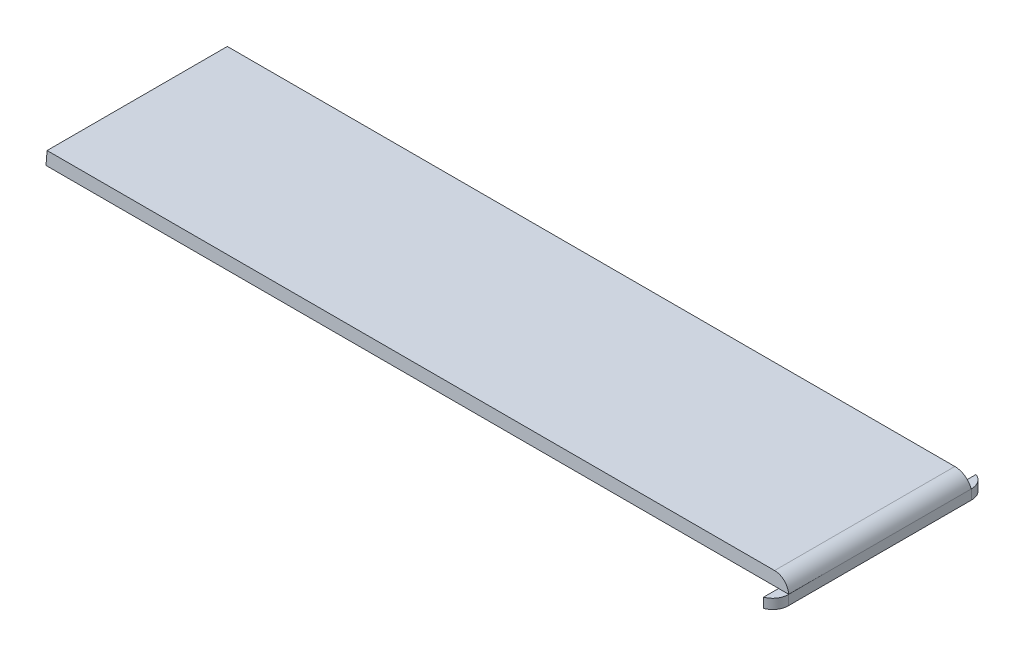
ISO-10303-21;
HEADER;
FILE_DESCRIPTION(('STEP AP214'),'2;1');
FILE_NAME('part.step','',(''),(''),'','','');
FILE_SCHEMA(('AUTOMOTIVE_DESIGN { 1 0 10303 214 1 1 1 1 }'));
ENDSEC;
DATA;
#1=APPLICATION_CONTEXT('core data for automotive mechanical design processes');
#2=APPLICATION_PROTOCOL_DEFINITION('international standard','automotive_design',2000,#1);
#3=PRODUCT_CONTEXT('',#1,'mechanical');
#4=PRODUCT('Part','Part','',(#3));
#5=PRODUCT_RELATED_PRODUCT_CATEGORY('part','',(#4));
#6=PRODUCT_DEFINITION_FORMATION('','',#4);
#7=PRODUCT_DEFINITION_CONTEXT('part definition',#1,'design');
#8=PRODUCT_DEFINITION('design','',#6,#7);
#9=PRODUCT_DEFINITION_SHAPE('','',#8);
#10=(LENGTH_UNIT() NAMED_UNIT(*) SI_UNIT(.MILLI.,.METRE.));
#11=(NAMED_UNIT(*) PLANE_ANGLE_UNIT() SI_UNIT($,.RADIAN.));
#12=(NAMED_UNIT(*) SI_UNIT($,.STERADIAN.) SOLID_ANGLE_UNIT());
#13=UNCERTAINTY_MEASURE_WITH_UNIT(LENGTH_MEASURE(1.E-05),#10,'distance_accuracy_value','');
#14=(GEOMETRIC_REPRESENTATION_CONTEXT(3) GLOBAL_UNCERTAINTY_ASSIGNED_CONTEXT((#13)) GLOBAL_UNIT_ASSIGNED_CONTEXT((#10,
#11,#12)) REPRESENTATION_CONTEXT('',''));
#15=CARTESIAN_POINT('',(0.,0.,0.));
#16=DIRECTION('',(0.,0.,1.));
#17=DIRECTION('',(1.,0.,0.));
#18=AXIS2_PLACEMENT_3D('',#15,#16,#17);
#19=CARTESIAN_POINT('',(0.,0.,0.));
#20=DIRECTION('',(0.,-1.,0.));
#21=DIRECTION('',(0.,0.,-1.));
#22=AXIS2_PLACEMENT_3D('',#19,#20,#21);
#23=PLANE('',#22);
#24=DIRECTION('',(1.,0.,0.));
#25=VECTOR('',#24,1.);
#26=CARTESIAN_POINT('',(-121.868681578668,0.,-11.3537769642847));
#27=LINE('',#26,#25);
#28=CARTESIAN_POINT('',(-121.412,0.,-11.3537769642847));
#29=VERTEX_POINT('',#28);
#30=CARTESIAN_POINT('',(-120.344681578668,0.,-11.3537769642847));
#31=VERTEX_POINT('',#30);
#32=EDGE_CURVE('E179',#29,#31,#27,.T.);
#33=ORIENTED_EDGE('',*,*,#32,.T.);
#34=CARTESIAN_POINT('',(-120.344681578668,0.,-12.6237769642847));
#35=DIRECTION('',(0.,1.,0.));
#36=DIRECTION('',(0.,0.,1.));
#37=AXIS2_PLACEMENT_3D('',#34,#35,#36);
#38=CIRCLE('',#37,1.26999999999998);
#39=CARTESIAN_POINT('',(-119.074681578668,0.,-12.6237769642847));
#40=VERTEX_POINT('',#39);
#41=EDGE_CURVE('E161',#31,#40,#38,.T.);
#42=ORIENTED_EDGE('',*,*,#41,.T.);
#43=DIRECTION('',(0.,0.,1.));
#44=VECTOR('',#43,1.);
#45=CARTESIAN_POINT('',(-119.074681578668,0.,-17.1957769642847));
#46=LINE('',#45,#44);
#47=CARTESIAN_POINT('',(-119.074681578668,0.,-17.1957769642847));
#48=VERTEX_POINT('',#47);
#49=EDGE_CURVE('E171',#48,#40,#46,.T.);
#50=ORIENTED_EDGE('',*,*,#49,.F.);
#51=CARTESIAN_POINT('',(-120.344681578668,0.,-17.1957769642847));
#52=DIRECTION('',(0.,1.,0.));
#53=DIRECTION('',(0.,0.,1.));
#54=AXIS2_PLACEMENT_3D('',#51,#52,#53);
#55=CIRCLE('',#54,1.27000000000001);
#56=CARTESIAN_POINT('',(-120.344681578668,0.,-18.4657769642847));
#57=VERTEX_POINT('',#56);
#58=EDGE_CURVE('E176',#48,#57,#55,.T.);
#59=ORIENTED_EDGE('',*,*,#58,.T.);
#60=DIRECTION('',(-1.,0.,0.));
#61=VECTOR('',#60,1.);
#62=CARTESIAN_POINT('',(-120.344681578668,0.,-18.4657769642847));
#63=LINE('',#62,#61);
#64=CARTESIAN_POINT('',(-121.412,0.,-18.4657769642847));
#65=VERTEX_POINT('',#64);
#66=EDGE_CURVE('E184',#57,#65,#63,.T.);
#67=ORIENTED_EDGE('',*,*,#66,.T.);
#68=DIRECTION('',(0.,0.,1.));
#69=VECTOR('',#68,1.);
#70=CARTESIAN_POINT('',(-121.412,0.,-29.8195539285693));
#71=LINE('',#70,#69);
#72=CARTESIAN_POINT('',(-121.412,0.,-29.8195539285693));
#73=VERTEX_POINT('',#72);
#74=EDGE_CURVE('E296',#73,#65,#71,.T.);
#75=ORIENTED_EDGE('',*,*,#74,.F.);
#76=DIRECTION('',(1.,0.,0.));
#77=VECTOR('',#76,1.);
#78=CARTESIAN_POINT('',(-121.412,0.,-29.8195539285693));
#79=LINE('',#78,#77);
#80=CARTESIAN_POINT('',(-1.651,0.,-29.8195539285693));
#81=VERTEX_POINT('',#80);
#82=EDGE_CURVE('E285',#73,#81,#79,.T.);
#83=ORIENTED_EDGE('',*,*,#82,.T.);
#84=DIRECTION('',(0.,0.,1.));
#85=VECTOR('',#84,1.);
#86=CARTESIAN_POINT('',(-1.651,0.,-32.2751212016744));
#87=LINE('',#86,#85);
#88=CARTESIAN_POINT('',(-1.65099999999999,0.,0.));
#89=VERTEX_POINT('',#88);
#90=EDGE_CURVE('E11',#81,#89,#87,.T.);
#91=ORIENTED_EDGE('',*,*,#90,.T.);
#92=DIRECTION('',(1.,0.,0.));
#93=VECTOR('',#92,1.);
#94=CARTESIAN_POINT('',(-121.412,0.,0.));
#95=LINE('',#94,#93);
#96=CARTESIAN_POINT('',(-121.412,0.,0.));
#97=VERTEX_POINT('',#96);
#98=EDGE_CURVE('E295',#97,#89,#95,.T.);
#99=ORIENTED_EDGE('',*,*,#98,.F.);
#100=EDGE_CURVE('E319',#29,#97,#71,.T.);
#101=ORIENTED_EDGE('',*,*,#100,.F.);
#102=EDGE_LOOP('',(#33,#42,#50,#59,#67,#75,#83,#91,#99,#101));
#103=FACE_BOUND('',#102,.T.);
#104=ADVANCED_FACE('F27',(#103),#23,.T.);
#105=CARTESIAN_POINT('',(-121.412,0.,-29.8195539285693));
#106=DIRECTION('',(0.,0.0871557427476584,-0.996194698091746));
#107=DIRECTION('',(0.,0.996194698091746,0.0871557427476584));
#108=AXIS2_PLACEMENT_3D('',#105,#106,#107);
#109=PLANE('',#108);
#110=DIRECTION('',(1.,0.,0.));
#111=VECTOR('',#110,1.);
#112=CARTESIAN_POINT('',(0.,2.032,-29.6417769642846));
#113=LINE('',#112,#111);
#114=CARTESIAN_POINT('',(-121.412,2.032,-29.6417769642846));
#115=VERTEX_POINT('',#114);
#116=CARTESIAN_POINT('',(-2.48868157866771,2.032,-29.6417769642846));
#117=VERTEX_POINT('',#116);
#118=EDGE_CURVE('E301',#115,#117,#113,.T.);
#119=ORIENTED_EDGE('',*,*,#118,.T.);
#120=CARTESIAN_POINT('',(-2.48868157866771,-0.508,-29.8639981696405));
#121=DIRECTION('',(0.,0.0871557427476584,-0.996194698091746));
#122=DIRECTION('',(0.,0.996194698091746,0.0871557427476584));
#123=AXIS2_PLACEMENT_3D('',#120,#121,#122);
#124=ELLIPSE('',#123,2.5497023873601,2.54);
#125=CARTESIAN_POINT('',(0.,0.,-29.8195539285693));
#126=VERTEX_POINT('',#125);
#127=EDGE_CURVE('E316',#117,#126,#124,.T.);
#128=ORIENTED_EDGE('',*,*,#127,.T.);
#129=EDGE_CURVE('E283',#81,#126,#79,.T.);
#130=ORIENTED_EDGE('',*,*,#129,.F.);
#131=ORIENTED_EDGE('',*,*,#82,.F.);
#132=DIRECTION('',(0.,-0.996194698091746,-0.0871557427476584));
#133=VECTOR('',#132,1.);
#134=CARTESIAN_POINT('',(-121.412,0.,-29.8195539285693));
#135=LINE('',#134,#133);
#136=EDGE_CURVE('E308',#115,#73,#135,.T.);
#137=ORIENTED_EDGE('',*,*,#136,.F.);
#138=EDGE_LOOP('',(#119,#128,#130,#131,#137));
#139=FACE_BOUND('',#138,.T.);
#140=ADVANCED_FACE('F29',(#139),#109,.T.);
#141=CARTESIAN_POINT('',(-121.412,2.032,-29.8195539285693));
#142=DIRECTION('',(1.,0.,0.));
#143=DIRECTION('',(0.,0.,-1.));
#144=AXIS2_PLACEMENT_3D('',#141,#142,#143);
#145=PLANE('',#144);
#146=ORIENTED_EDGE('',*,*,#74,.T.);
#147=EDGE_CURVE('E322',#65,#29,#71,.T.);
#148=ORIENTED_EDGE('',*,*,#147,.T.);
#149=ORIENTED_EDGE('',*,*,#100,.T.);
#150=DIRECTION('',(0.,0.996194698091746,-0.0871557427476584));
#151=VECTOR('',#150,1.);
#152=CARTESIAN_POINT('',(-121.412,0.,0.));
#153=LINE('',#152,#151);
#154=CARTESIAN_POINT('',(-121.412,2.032,-0.177776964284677));
#155=VERTEX_POINT('',#154);
#156=EDGE_CURVE('E305',#155,#97,#153,.F.);
#157=ORIENTED_EDGE('',*,*,#156,.F.);
#158=DIRECTION('',(0.,0.,1.));
#159=VECTOR('',#158,1.);
#160=CARTESIAN_POINT('',(-121.412,2.032,-29.8195539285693));
#161=LINE('',#160,#159);
#162=EDGE_CURVE('E302',#115,#155,#161,.T.);
#163=ORIENTED_EDGE('',*,*,#162,.F.);
#164=ORIENTED_EDGE('',*,*,#136,.T.);
#165=EDGE_LOOP('',(#146,#148,#149,#157,#163,#164));
#166=FACE_BOUND('',#165,.T.);
#167=ADVANCED_FACE('F327',(#166),#145,.F.);
#168=CARTESIAN_POINT('',(-121.412,0.,0.));
#169=DIRECTION('',(0.,0.0871557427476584,0.996194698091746));
#170=DIRECTION('',(0.,-0.996194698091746,0.0871557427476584));
#171=AXIS2_PLACEMENT_3D('',#168,#169,#170);
#172=PLANE('',#171);
#173=ORIENTED_EDGE('',*,*,#98,.T.);
#174=CARTESIAN_POINT('',(0.,0.,0.));
#175=VERTEX_POINT('',#174);
#176=EDGE_CURVE('E293',#89,#175,#95,.T.);
#177=ORIENTED_EDGE('',*,*,#176,.T.);
#178=CARTESIAN_POINT('',(-2.48868157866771,-0.508,0.0444442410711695));
#179=DIRECTION('',(0.,0.0871557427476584,0.996194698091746));
#180=DIRECTION('',(0.,-0.996194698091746,0.0871557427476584));
#181=AXIS2_PLACEMENT_3D('',#178,#179,#180);
#182=ELLIPSE('',#181,2.5497023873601,2.54);
#183=CARTESIAN_POINT('',(-2.48868157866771,2.032,-0.177776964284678));
#184=VERTEX_POINT('',#183);
#185=EDGE_CURVE('E36',#175,#184,#182,.T.);
#186=ORIENTED_EDGE('',*,*,#185,.T.);
#187=DIRECTION('',(-1.,0.,0.));
#188=VECTOR('',#187,1.);
#189=CARTESIAN_POINT('',(0.,2.032,-0.177776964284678));
#190=LINE('',#189,#188);
#191=EDGE_CURVE('E304',#155,#184,#190,.F.);
#192=ORIENTED_EDGE('',*,*,#191,.F.);
#193=ORIENTED_EDGE('',*,*,#156,.T.);
#194=EDGE_LOOP('',(#173,#177,#186,#192,#193));
#195=FACE_BOUND('',#194,.T.);
#196=ADVANCED_FACE('F341',(#195),#172,.T.);
#197=CARTESIAN_POINT('',(0.,2.032,0.));
#198=DIRECTION('',(0.,-1.,0.));
#199=DIRECTION('',(0.,0.,-1.));
#200=AXIS2_PLACEMENT_3D('',#197,#198,#199);
#201=PLANE('',#200);
#202=ORIENTED_EDGE('',*,*,#191,.T.);
#203=DIRECTION('',(0.,0.,1.));
#204=VECTOR('',#203,1.);
#205=CARTESIAN_POINT('',(-2.48868157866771,2.032,0.));
#206=LINE('',#205,#204);
#207=EDGE_CURVE('E314',#184,#117,#206,.F.);
#208=ORIENTED_EDGE('',*,*,#207,.T.);
#209=ORIENTED_EDGE('',*,*,#118,.F.);
#210=ORIENTED_EDGE('',*,*,#162,.T.);
#211=EDGE_LOOP('',(#202,#208,#209,#210));
#212=FACE_BOUND('',#211,.T.);
#213=ADVANCED_FACE('F345',(#212),#201,.F.);
#214=CARTESIAN_POINT('',(-2.48868157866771,-0.508,0.));
#215=DIRECTION('',(0.,0.,1.));
#216=DIRECTION('',(1.,0.,0.));
#217=AXIS2_PLACEMENT_3D('',#214,#215,#216);
#218=CYLINDRICAL_SURFACE('',#217,2.54);
#219=ORIENTED_EDGE('',*,*,#185,.F.);
#220=DIRECTION('',(0.,0.,-1.));
#221=VECTOR('',#220,1.);
#222=CARTESIAN_POINT('',(0.,0.,0.));
#223=LINE('',#222,#221);
#224=EDGE_CURVE('E245',#175,#126,#223,.T.);
#225=ORIENTED_EDGE('',*,*,#224,.T.);
#226=ORIENTED_EDGE('',*,*,#127,.F.);
#227=ORIENTED_EDGE('',*,*,#207,.F.);
#228=EDGE_LOOP('',(#219,#225,#226,#227));
#229=FACE_BOUND('',#228,.T.);
#230=ADVANCED_FACE('F347',(#229),#218,.T.);
#231=CARTESIAN_POINT('',(-2.54,0.,-29.8957769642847));
#232=DIRECTION('',(0.,-1.,0.));
#233=DIRECTION('',(0.,0.,-1.));
#234=AXIS2_PLACEMENT_3D('',#231,#232,#233);
#235=PLANE('',#234);
#236=CARTESIAN_POINT('',(-1.651,0.,-32.2751212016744));
#237=VERTEX_POINT('',#236);
#238=EDGE_CURVE('E38',#237,#81,#87,.T.);
#239=ORIENTED_EDGE('',*,*,#238,.T.);
#240=ORIENTED_EDGE('',*,*,#129,.T.);
#241=DIRECTION('',(0.,0.,-1.));
#242=VECTOR('',#241,1.);
#243=CARTESIAN_POINT('',(0.,0.,0.0762230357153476));
#244=LINE('',#243,#242);
#245=CARTESIAN_POINT('',(0.,0.,-29.8957769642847));
#246=VERTEX_POINT('',#245);
#247=EDGE_CURVE('E231',#126,#246,#244,.T.);
#248=ORIENTED_EDGE('',*,*,#247,.T.);
#249=CARTESIAN_POINT('',(-2.54,0.,-29.8957769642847));
#250=DIRECTION('',(0.,-1.,0.));
#251=DIRECTION('',(0.,0.,-1.));
#252=AXIS2_PLACEMENT_3D('',#249,#250,#251);
#253=CIRCLE('',#252,2.54);
#254=EDGE_CURVE('E215',#237,#246,#253,.T.);
#255=ORIENTED_EDGE('',*,*,#254,.F.);
#256=EDGE_LOOP('',(#239,#240,#248,#255));
#257=FACE_BOUND('',#256,.T.);
#258=ADVANCED_FACE('F331',(#257),#235,.F.);
#259=CARTESIAN_POINT('',(-2.54,-1.6002,-29.8957769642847));
#260=DIRECTION('',(0.,1.,0.));
#261=DIRECTION('',(0.,0.,1.));
#262=AXIS2_PLACEMENT_3D('',#259,#260,#261);
#263=CYLINDRICAL_SURFACE('',#262,2.54);
#264=ORIENTED_EDGE('',*,*,#254,.T.);
#265=DIRECTION('',(0.,1.,0.));
#266=VECTOR('',#265,1.);
#267=CARTESIAN_POINT('',(0.,-1.6002,-29.8957769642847));
#268=LINE('',#267,#266);
#269=CARTESIAN_POINT('',(0.,-1.6002,-29.8957769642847));
#270=VERTEX_POINT('',#269);
#271=EDGE_CURVE('E242',#270,#246,#268,.T.);
#272=ORIENTED_EDGE('',*,*,#271,.F.);
#273=CARTESIAN_POINT('',(-2.54,-1.6002,-29.8957769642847));
#274=DIRECTION('',(0.,-1.,0.));
#275=DIRECTION('',(0.,0.,-1.));
#276=AXIS2_PLACEMENT_3D('',#273,#274,#275);
#277=CIRCLE('',#276,2.54);
#278=CARTESIAN_POINT('',(-1.651,-1.6002,-32.2751212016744));
#279=VERTEX_POINT('',#278);
#280=EDGE_CURVE('E260',#279,#270,#277,.T.);
#281=ORIENTED_EDGE('',*,*,#280,.F.);
#282=DIRECTION('',(0.,1.,0.));
#283=VECTOR('',#282,1.);
#284=CARTESIAN_POINT('',(-1.651,-1.6002,-32.2751212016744));
#285=LINE('',#284,#283);
#286=EDGE_CURVE('E250',#279,#237,#285,.T.);
#287=ORIENTED_EDGE('',*,*,#286,.T.);
#288=EDGE_LOOP('',(#264,#272,#281,#287));
#289=FACE_BOUND('',#288,.T.);
#290=ADVANCED_FACE('F336',(#289),#263,.T.);
#291=CARTESIAN_POINT('',(0.,-1.6002,0.0762230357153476));
#292=DIRECTION('',(1.,0.,0.));
#293=DIRECTION('',(0.,0.,-1.));
#294=AXIS2_PLACEMENT_3D('',#291,#292,#293);
#295=PLANE('',#294);
#296=CARTESIAN_POINT('',(0.,0.,0.0762230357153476));
#297=VERTEX_POINT('',#296);
#298=EDGE_CURVE('E239',#297,#175,#244,.T.);
#299=ORIENTED_EDGE('',*,*,#298,.F.);
#300=DIRECTION('',(0.,1.,0.));
#301=VECTOR('',#300,1.);
#302=CARTESIAN_POINT('',(0.,-1.6002,0.0762230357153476));
#303=LINE('',#302,#301);
#304=CARTESIAN_POINT('',(0.,-1.6002,0.0762230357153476));
#305=VERTEX_POINT('',#304);
#306=EDGE_CURVE('E246',#305,#297,#303,.T.);
#307=ORIENTED_EDGE('',*,*,#306,.F.);
#308=DIRECTION('',(0.,0.,-1.));
#309=VECTOR('',#308,1.);
#310=CARTESIAN_POINT('',(0.,-1.6002,0.0762230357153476));
#311=LINE('',#310,#309);
#312=EDGE_CURVE('E257',#305,#270,#311,.T.);
#313=ORIENTED_EDGE('',*,*,#312,.T.);
#314=ORIENTED_EDGE('',*,*,#271,.T.);
#315=ORIENTED_EDGE('',*,*,#247,.F.);
#316=ORIENTED_EDGE('',*,*,#224,.F.);
#317=EDGE_LOOP('',(#299,#307,#313,#314,#315,#316));
#318=FACE_BOUND('',#317,.T.);
#319=ADVANCED_FACE('F277',(#318),#295,.T.);
#320=CARTESIAN_POINT('',(-2.53999999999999,-1.6002,0.0762230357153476));
#321=DIRECTION('',(0.,1.,0.));
#322=DIRECTION('',(0.,0.,1.));
#323=AXIS2_PLACEMENT_3D('',#320,#321,#322);
#324=CYLINDRICAL_SURFACE('',#323,2.54);
#325=CARTESIAN_POINT('',(-2.53999999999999,0.,0.0762230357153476));
#326=DIRECTION('',(0.,-1.,0.));
#327=DIRECTION('',(0.,0.,-1.));
#328=AXIS2_PLACEMENT_3D('',#325,#326,#327);
#329=CIRCLE('',#328,2.54);
#330=CARTESIAN_POINT('',(-1.65099999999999,0.,2.45556727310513));
#331=VERTEX_POINT('',#330);
#332=EDGE_CURVE('E234',#297,#331,#329,.T.);
#333=ORIENTED_EDGE('',*,*,#332,.T.);
#334=DIRECTION('',(0.,1.,0.));
#335=VECTOR('',#334,1.);
#336=CARTESIAN_POINT('',(-1.65099999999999,-1.6002,2.45556727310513));
#337=LINE('',#336,#335);
#338=CARTESIAN_POINT('',(-1.65099999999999,-1.6002,2.45556727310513));
#339=VERTEX_POINT('',#338);
#340=EDGE_CURVE('E248',#339,#331,#337,.T.);
#341=ORIENTED_EDGE('',*,*,#340,.F.);
#342=CARTESIAN_POINT('',(-2.53999999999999,-1.6002,0.0762230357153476));
#343=DIRECTION('',(0.,-1.,0.));
#344=DIRECTION('',(0.,0.,-1.));
#345=AXIS2_PLACEMENT_3D('',#342,#343,#344);
#346=CIRCLE('',#345,2.54);
#347=EDGE_CURVE('E255',#305,#339,#346,.T.);
#348=ORIENTED_EDGE('',*,*,#347,.F.);
#349=ORIENTED_EDGE('',*,*,#306,.T.);
#350=EDGE_LOOP('',(#333,#341,#348,#349));
#351=FACE_BOUND('',#350,.T.);
#352=ADVANCED_FACE('F271',(#351),#324,.T.);
#353=CARTESIAN_POINT('',(-1.651,-1.6002,-32.2751212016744));
#354=DIRECTION('',(-1.,0.,0.));
#355=DIRECTION('',(0.,0.,1.));
#356=AXIS2_PLACEMENT_3D('',#353,#354,#355);
#357=PLANE('',#356);
#358=ORIENTED_EDGE('',*,*,#238,.F.);
#359=ORIENTED_EDGE('',*,*,#286,.F.);
#360=DIRECTION('',(0.,0.,1.));
#361=VECTOR('',#360,1.);
#362=CARTESIAN_POINT('',(-1.651,-1.6002,-32.2751212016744));
#363=LINE('',#362,#361);
#364=EDGE_CURVE('E252',#279,#339,#363,.T.);
#365=ORIENTED_EDGE('',*,*,#364,.T.);
#366=ORIENTED_EDGE('',*,*,#340,.T.);
#367=EDGE_CURVE('E39',#89,#331,#87,.T.);
#368=ORIENTED_EDGE('',*,*,#367,.F.);
#369=ORIENTED_EDGE('',*,*,#90,.F.);
#370=EDGE_LOOP('',(#358,#359,#365,#366,#368,#369));
#371=FACE_BOUND('',#370,.T.);
#372=ADVANCED_FACE('F338',(#371),#357,.T.);
#373=CARTESIAN_POINT('',(-2.54,-1.6002,-29.8957769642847));
#374=DIRECTION('',(0.,-1.,0.));
#375=DIRECTION('',(0.,0.,-1.));
#376=AXIS2_PLACEMENT_3D('',#373,#374,#375);
#377=PLANE('',#376);
#378=ORIENTED_EDGE('',*,*,#280,.T.);
#379=ORIENTED_EDGE('',*,*,#312,.F.);
#380=ORIENTED_EDGE('',*,*,#347,.T.);
#381=ORIENTED_EDGE('',*,*,#364,.F.);
#382=EDGE_LOOP('',(#378,#379,#380,#381));
#383=FACE_BOUND('',#382,.T.);
#384=ADVANCED_FACE('F405',(#383),#377,.T.);
#385=ORIENTED_EDGE('',*,*,#176,.F.);
#386=ORIENTED_EDGE('',*,*,#367,.T.);
#387=ORIENTED_EDGE('',*,*,#332,.F.);
#388=ORIENTED_EDGE('',*,*,#298,.T.);
#389=EDGE_LOOP('',(#385,#386,#387,#388));
#390=FACE_BOUND('',#389,.T.);
#391=ADVANCED_FACE('F274',(#390),#235,.F.);
#392=CARTESIAN_POINT('',(-120.344681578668,0.,-12.6237769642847));
#393=DIRECTION('',(0.,1.,0.));
#394=DIRECTION('',(0.,0.,1.));
#395=AXIS2_PLACEMENT_3D('',#392,#393,#394);
#396=PLANE('',#395);
#397=ORIENTED_EDGE('',*,*,#147,.F.);
#398=CARTESIAN_POINT('',(-121.868681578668,0.,-18.4657769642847));
#399=VERTEX_POINT('',#398);
#400=EDGE_CURVE('E183',#65,#399,#63,.T.);
#401=ORIENTED_EDGE('',*,*,#400,.T.);
#402=CARTESIAN_POINT('',(-121.868681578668,0.,-17.1957769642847));
#403=DIRECTION('',(0.,-1.,0.));
#404=DIRECTION('',(0.,0.,-1.));
#405=AXIS2_PLACEMENT_3D('',#402,#403,#404);
#406=CIRCLE('',#405,1.27);
#407=CARTESIAN_POINT('',(-123.138681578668,0.,-17.1957769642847));
#408=VERTEX_POINT('',#407);
#409=EDGE_CURVE('E187',#408,#399,#406,.T.);
#410=ORIENTED_EDGE('',*,*,#409,.F.);
#411=DIRECTION('',(0.,0.,-1.));
#412=VECTOR('',#411,1.);
#413=CARTESIAN_POINT('',(-123.138681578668,0.,-12.6237769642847));
#414=LINE('',#413,#412);
#415=CARTESIAN_POINT('',(-123.138681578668,0.,-12.6237769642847));
#416=VERTEX_POINT('',#415);
#417=EDGE_CURVE('E190',#416,#408,#414,.T.);
#418=ORIENTED_EDGE('',*,*,#417,.F.);
#419=CARTESIAN_POINT('',(-121.868681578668,0.,-12.6237769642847));
#420=DIRECTION('',(0.,1.,0.));
#421=DIRECTION('',(0.,0.,1.));
#422=AXIS2_PLACEMENT_3D('',#419,#420,#421);
#423=CIRCLE('',#422,1.27);
#424=CARTESIAN_POINT('',(-121.868681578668,0.,-11.3537769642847));
#425=VERTEX_POINT('',#424);
#426=EDGE_CURVE('E192',#416,#425,#423,.T.);
#427=ORIENTED_EDGE('',*,*,#426,.T.);
#428=EDGE_CURVE('E46',#425,#29,#27,.T.);
#429=ORIENTED_EDGE('',*,*,#428,.T.);
#430=EDGE_LOOP('',(#397,#401,#410,#418,#427,#429));
#431=FACE_BOUND('',#430,.T.);
#432=ADVANCED_FACE('F419',(#431),#396,.T.);
#433=CARTESIAN_POINT('',(-120.344681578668,-1.905,-12.6237769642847));
#434=DIRECTION('',(0.,1.,0.));
#435=DIRECTION('',(0.,0.,1.));
#436=AXIS2_PLACEMENT_3D('',#433,#434,#435);
#437=CYLINDRICAL_SURFACE('',#436,1.26999999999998);
#438=ORIENTED_EDGE('',*,*,#41,.F.);
#439=DIRECTION('',(0.,1.,0.));
#440=VECTOR('',#439,1.);
#441=CARTESIAN_POINT('',(-120.344681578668,-1.905,-11.3537769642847));
#442=LINE('',#441,#440);
#443=CARTESIAN_POINT('',(-120.344681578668,-1.905,-11.3537769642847));
#444=VERTEX_POINT('',#443);
#445=EDGE_CURVE('E213',#444,#31,#442,.T.);
#446=ORIENTED_EDGE('',*,*,#445,.F.);
#447=CARTESIAN_POINT('',(-120.344681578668,-1.905,-12.6237769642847));
#448=DIRECTION('',(0.,1.,0.));
#449=DIRECTION('',(0.,0.,1.));
#450=AXIS2_PLACEMENT_3D('',#447,#448,#449);
#451=CIRCLE('',#450,1.26999999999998);
#452=CARTESIAN_POINT('',(-119.074681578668,-1.905,-12.6237769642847));
#453=VERTEX_POINT('',#452);
#454=EDGE_CURVE('E164',#444,#453,#451,.T.);
#455=ORIENTED_EDGE('',*,*,#454,.T.);
#456=DIRECTION('',(0.,1.,0.));
#457=VECTOR('',#456,1.);
#458=CARTESIAN_POINT('',(-119.074681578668,-1.905,-12.6237769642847));
#459=LINE('',#458,#457);
#460=EDGE_CURVE('E157',#453,#40,#459,.T.);
#461=ORIENTED_EDGE('',*,*,#460,.T.);
#462=EDGE_LOOP('',(#438,#446,#455,#461));
#463=FACE_BOUND('',#462,.T.);
#464=ADVANCED_FACE('F159',(#463),#437,.T.);
#465=CARTESIAN_POINT('',(-121.868681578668,-1.905,-11.3537769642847));
#466=DIRECTION('',(0.,0.,1.));
#467=DIRECTION('',(1.,0.,0.));
#468=AXIS2_PLACEMENT_3D('',#465,#466,#467);
#469=PLANE('',#468);
#470=ORIENTED_EDGE('',*,*,#428,.F.);
#471=DIRECTION('',(0.,1.,0.));
#472=VECTOR('',#471,1.);
#473=CARTESIAN_POINT('',(-121.868681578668,-1.905,-11.3537769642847));
#474=LINE('',#473,#472);
#475=CARTESIAN_POINT('',(-121.868681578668,-1.905,-11.3537769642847));
#476=VERTEX_POINT('',#475);
#477=EDGE_CURVE('E216',#476,#425,#474,.T.);
#478=ORIENTED_EDGE('',*,*,#477,.F.);
#479=DIRECTION('',(1.,0.,0.));
#480=VECTOR('',#479,1.);
#481=CARTESIAN_POINT('',(-121.868681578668,-1.905,-11.3537769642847));
#482=LINE('',#481,#480);
#483=EDGE_CURVE('E168',#476,#444,#482,.T.);
#484=ORIENTED_EDGE('',*,*,#483,.T.);
#485=ORIENTED_EDGE('',*,*,#445,.T.);
#486=ORIENTED_EDGE('',*,*,#32,.F.);
#487=EDGE_LOOP('',(#470,#478,#484,#485,#486));
#488=FACE_BOUND('',#487,.T.);
#489=ADVANCED_FACE('F431',(#488),#469,.T.);
#490=CARTESIAN_POINT('',(-121.868681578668,-1.905,-12.6237769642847));
#491=DIRECTION('',(0.,1.,0.));
#492=DIRECTION('',(0.,0.,1.));
#493=AXIS2_PLACEMENT_3D('',#490,#491,#492);
#494=CYLINDRICAL_SURFACE('',#493,1.27);
#495=ORIENTED_EDGE('',*,*,#426,.F.);
#496=DIRECTION('',(0.,1.,0.));
#497=VECTOR('',#496,1.);
#498=CARTESIAN_POINT('',(-123.138681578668,-1.905,-12.6237769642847));
#499=LINE('',#498,#497);
#500=CARTESIAN_POINT('',(-123.138681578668,-1.905,-12.6237769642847));
#501=VERTEX_POINT('',#500);
#502=EDGE_CURVE('E218',#501,#416,#499,.T.);
#503=ORIENTED_EDGE('',*,*,#502,.F.);
#504=CARTESIAN_POINT('',(-121.868681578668,-1.905,-12.6237769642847));
#505=DIRECTION('',(0.,1.,0.));
#506=DIRECTION('',(0.,0.,1.));
#507=AXIS2_PLACEMENT_3D('',#504,#505,#506);
#508=CIRCLE('',#507,1.27);
#509=EDGE_CURVE('E208',#501,#476,#508,.T.);
#510=ORIENTED_EDGE('',*,*,#509,.T.);
#511=ORIENTED_EDGE('',*,*,#477,.T.);
#512=EDGE_LOOP('',(#495,#503,#510,#511));
#513=FACE_BOUND('',#512,.T.);
#514=ADVANCED_FACE('F438',(#513),#494,.T.);
#515=CARTESIAN_POINT('',(-123.138681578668,-1.905,-12.6237769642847));
#516=DIRECTION('',(1.,0.,0.));
#517=DIRECTION('',(0.,0.,-1.));
#518=AXIS2_PLACEMENT_3D('',#515,#516,#517);
#519=PLANE('',#518);
#520=ORIENTED_EDGE('',*,*,#417,.T.);
#521=DIRECTION('',(0.,1.,0.));
#522=VECTOR('',#521,1.);
#523=CARTESIAN_POINT('',(-123.138681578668,-1.905,-17.1957769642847));
#524=LINE('',#523,#522);
#525=CARTESIAN_POINT('',(-123.138681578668,-1.905,-17.1957769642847));
#526=VERTEX_POINT('',#525);
#527=EDGE_CURVE('E220',#526,#408,#524,.T.);
#528=ORIENTED_EDGE('',*,*,#527,.F.);
#529=DIRECTION('',(0.,0.,-1.));
#530=VECTOR('',#529,1.);
#531=CARTESIAN_POINT('',(-123.138681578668,-1.905,-12.6237769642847));
#532=LINE('',#531,#530);
#533=EDGE_CURVE('E206',#501,#526,#532,.T.);
#534=ORIENTED_EDGE('',*,*,#533,.F.);
#535=ORIENTED_EDGE('',*,*,#502,.T.);
#536=EDGE_LOOP('',(#520,#528,#534,#535));
#537=FACE_BOUND('',#536,.T.);
#538=ADVANCED_FACE('F446',(#537),#519,.F.);
#539=CARTESIAN_POINT('',(-121.868681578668,-1.905,-17.1957769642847));
#540=DIRECTION('',(0.,1.,0.));
#541=DIRECTION('',(0.,0.,1.));
#542=AXIS2_PLACEMENT_3D('',#539,#540,#541);
#543=CYLINDRICAL_SURFACE('',#542,1.27);
#544=ORIENTED_EDGE('',*,*,#409,.T.);
#545=DIRECTION('',(0.,1.,0.));
#546=VECTOR('',#545,1.);
#547=CARTESIAN_POINT('',(-121.868681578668,-1.905,-18.4657769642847));
#548=LINE('',#547,#546);
#549=CARTESIAN_POINT('',(-121.868681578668,-1.905,-18.4657769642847));
#550=VERTEX_POINT('',#549);
#551=EDGE_CURVE('E223',#550,#399,#548,.T.);
#552=ORIENTED_EDGE('',*,*,#551,.F.);
#553=CARTESIAN_POINT('',(-121.868681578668,-1.905,-17.1957769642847));
#554=DIRECTION('',(0.,-1.,0.));
#555=DIRECTION('',(0.,0.,-1.));
#556=AXIS2_PLACEMENT_3D('',#553,#554,#555);
#557=CIRCLE('',#556,1.27);
#558=EDGE_CURVE('E204',#526,#550,#557,.T.);
#559=ORIENTED_EDGE('',*,*,#558,.F.);
#560=ORIENTED_EDGE('',*,*,#527,.T.);
#561=EDGE_LOOP('',(#544,#552,#559,#560));
#562=FACE_BOUND('',#561,.T.);
#563=ADVANCED_FACE('F454',(#562),#543,.T.);
#564=CARTESIAN_POINT('',(-120.344681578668,-1.905,-18.4657769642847));
#565=DIRECTION('',(0.,0.,-1.));
#566=DIRECTION('',(-1.,0.,0.));
#567=AXIS2_PLACEMENT_3D('',#564,#565,#566);
#568=PLANE('',#567);
#569=ORIENTED_EDGE('',*,*,#66,.F.);
#570=DIRECTION('',(0.,1.,0.));
#571=VECTOR('',#570,1.);
#572=CARTESIAN_POINT('',(-120.344681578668,-1.905,-18.4657769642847));
#573=LINE('',#572,#571);
#574=CARTESIAN_POINT('',(-120.344681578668,-1.905,-18.4657769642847));
#575=VERTEX_POINT('',#574);
#576=EDGE_CURVE('E226',#575,#57,#573,.T.);
#577=ORIENTED_EDGE('',*,*,#576,.F.);
#578=DIRECTION('',(-1.,0.,0.));
#579=VECTOR('',#578,1.);
#580=CARTESIAN_POINT('',(-120.344681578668,-1.905,-18.4657769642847));
#581=LINE('',#580,#579);
#582=EDGE_CURVE('E201',#575,#550,#581,.T.);
#583=ORIENTED_EDGE('',*,*,#582,.T.);
#584=ORIENTED_EDGE('',*,*,#551,.T.);
#585=ORIENTED_EDGE('',*,*,#400,.F.);
#586=EDGE_LOOP('',(#569,#577,#583,#584,#585));
#587=FACE_BOUND('',#586,.T.);
#588=ADVANCED_FACE('F462',(#587),#568,.T.);
#589=CARTESIAN_POINT('',(-120.344681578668,-1.905,-17.1957769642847));
#590=DIRECTION('',(0.,1.,0.));
#591=DIRECTION('',(0.,0.,1.));
#592=AXIS2_PLACEMENT_3D('',#589,#590,#591);
#593=CYLINDRICAL_SURFACE('',#592,1.27000000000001);
#594=ORIENTED_EDGE('',*,*,#58,.F.);
#595=DIRECTION('',(0.,1.,0.));
#596=VECTOR('',#595,1.);
#597=CARTESIAN_POINT('',(-119.074681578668,-1.905,-17.1957769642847));
#598=LINE('',#597,#596);
#599=CARTESIAN_POINT('',(-119.074681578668,-1.905,-17.1957769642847));
#600=VERTEX_POINT('',#599);
#601=EDGE_CURVE('E167',#600,#48,#598,.T.);
#602=ORIENTED_EDGE('',*,*,#601,.F.);
#603=CARTESIAN_POINT('',(-120.344681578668,-1.905,-17.1957769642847));
#604=DIRECTION('',(0.,1.,0.));
#605=DIRECTION('',(0.,0.,1.));
#606=AXIS2_PLACEMENT_3D('',#603,#604,#605);
#607=CIRCLE('',#606,1.27000000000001);
#608=EDGE_CURVE('E198',#600,#575,#607,.T.);
#609=ORIENTED_EDGE('',*,*,#608,.T.);
#610=ORIENTED_EDGE('',*,*,#576,.T.);
#611=EDGE_LOOP('',(#594,#602,#609,#610));
#612=FACE_BOUND('',#611,.T.);
#613=ADVANCED_FACE('F470',(#612),#593,.T.);
#614=CARTESIAN_POINT('',(-119.074681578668,-1.905,-17.1957769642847));
#615=DIRECTION('',(-1.,0.,0.));
#616=DIRECTION('',(0.,0.,1.));
#617=AXIS2_PLACEMENT_3D('',#614,#615,#616);
#618=PLANE('',#617);
#619=ORIENTED_EDGE('',*,*,#49,.T.);
#620=ORIENTED_EDGE('',*,*,#460,.F.);
#621=DIRECTION('',(0.,0.,1.));
#622=VECTOR('',#621,1.);
#623=CARTESIAN_POINT('',(-119.074681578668,-1.905,-17.1957769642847));
#624=LINE('',#623,#622);
#625=EDGE_CURVE('E196',#600,#453,#624,.T.);
#626=ORIENTED_EDGE('',*,*,#625,.F.);
#627=ORIENTED_EDGE('',*,*,#601,.T.);
#628=EDGE_LOOP('',(#619,#620,#626,#627));
#629=FACE_BOUND('',#628,.T.);
#630=ADVANCED_FACE('F172',(#629),#618,.F.);
#631=CARTESIAN_POINT('',(-120.344681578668,-1.905,-12.6237769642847));
#632=DIRECTION('',(0.,1.,0.));
#633=DIRECTION('',(0.,0.,1.));
#634=AXIS2_PLACEMENT_3D('',#631,#632,#633);
#635=PLANE('',#634);
#636=ORIENTED_EDGE('',*,*,#454,.F.);
#637=ORIENTED_EDGE('',*,*,#483,.F.);
#638=ORIENTED_EDGE('',*,*,#509,.F.);
#639=ORIENTED_EDGE('',*,*,#533,.T.);
#640=ORIENTED_EDGE('',*,*,#558,.T.);
#641=ORIENTED_EDGE('',*,*,#582,.F.);
#642=ORIENTED_EDGE('',*,*,#608,.F.);
#643=ORIENTED_EDGE('',*,*,#625,.T.);
#644=EDGE_LOOP('',(#636,#637,#638,#639,#640,#641,#642,#643));
#645=FACE_BOUND('',#644,.T.);
#646=ADVANCED_FACE('F485',(#645),#635,.F.);
#647=CLOSED_SHELL('',(#104,#140,#167,#196,#213,#230,#258,#290,#319,#352,#372,#384,#391,#432,
#464,#489,#514,#538,#563,#588,#613,#630,#646));
#648=MANIFOLD_SOLID_BREP('B2',#647);
#649=ADVANCED_BREP_SHAPE_REPRESENTATION('',(#18,#648),#14);
#650=SHAPE_DEFINITION_REPRESENTATION(#9,#649);
ENDSEC;
END-ISO-10303-21;
